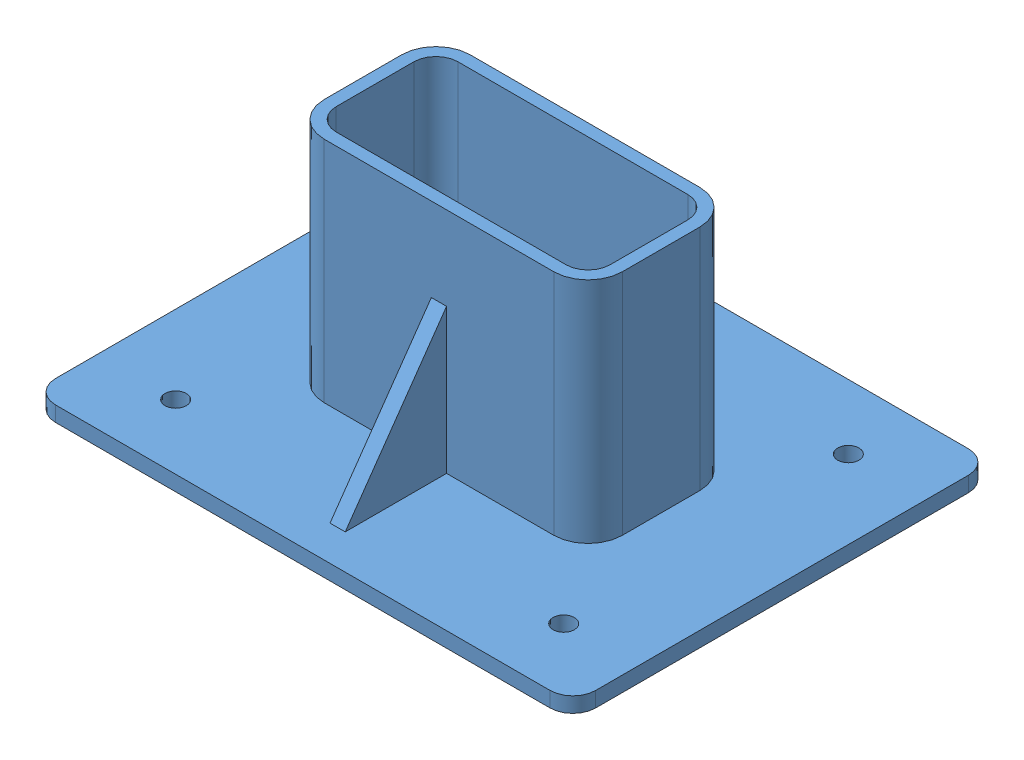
SolidWorks assembly Ensamble perfil-suelo (cortado).SLDASM, configuration Predeterminado (file format 12000). Lengths in mm.
Overall size (355 3010 275).
3 component instances, 2 part files, 3 mates.
Components (placement in the parent):
- Ensamble perfil-suelo-1: Ensamble perfil-suelo.SLDASM [Predeterminado] at (-261.8636 -1453.6762 2655) size (355 160 275)
  - Anclaje-1: Anclaje.SLDPRT [Predeterminado] at (-35.129 -88.7163 355) size (355 160 275)
- Principal 3m (Cortado) ABTO-1: Principal 3m (Cortado) ABTO.SLDPRT [Predeterminado] at (-296.9926 -1542.3924 3010) size (180 3000 80)
Mates (geometry in assembly coordinates):
- Coincidente1: coincident anti-aligned: plane of Ensamble perfil-suelo-1/Anclaje-1 through (-296.9926 -1542.3924 3010) normal (0 1 0); plane of Principal 3m (Cortado)-1 through (-212.2988 -1542.3924 2979.4282) normal (0 -1 0)
- Coincidente2: coincident anti-aligned: plane of Ensamble perfil-suelo-1/Anclaje-1 through (-296.9926 -1392.3924 3050) normal (0 0 -1); plane of Principal 3m (Cortado)-1 through (-221.4926 1457.6076 3050) normal (0 0 1)
- Coincidente3: coincident anti-aligned: plane of Ensamble perfil-suelo-1/Anclaje-1 through (-386.9926 -1392.3924 3010) normal (1 0 0); plane of Principal 3m (Cortado)-1 through (-386.9926 1457.6076 3025.8204) normal (-1 0 0)
